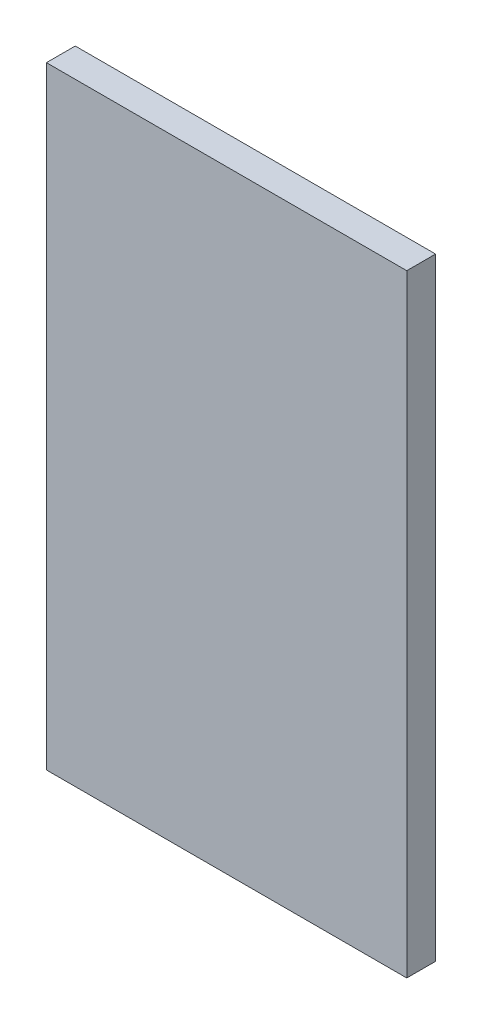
from build123d import *

# Parameters (mm, degrees)
SKETCH1_W            = 34
SKETCH1_H            = 1.6
PANEL_OR_BLOCK_DEPTH = 20


with BuildPart() as part:
    # Sketch1 → Panel_or_block (new body)
    with BuildSketch(Plane.YZ):
        with Locations((17, 0.8)):
            Rectangle(SKETCH1_W, SKETCH1_H)
    extrude(amount=PANEL_OR_BLOCK_DEPTH)


solid = part.part
